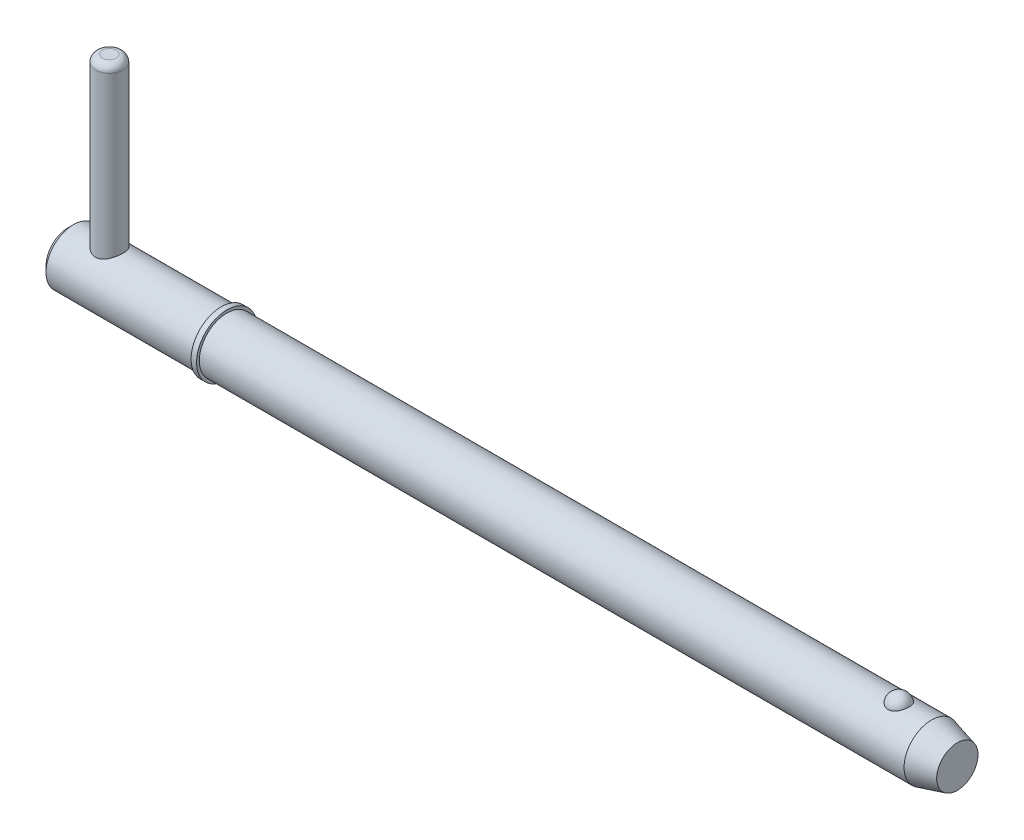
ISO-10303-21;
HEADER;
FILE_DESCRIPTION(('STEP AP214'),'2;1');
FILE_NAME('part.step','',(''),(''),'','','');
FILE_SCHEMA(('AUTOMOTIVE_DESIGN { 1 0 10303 214 1 1 1 1 }'));
ENDSEC;
DATA;
#1=APPLICATION_CONTEXT('core data for automotive mechanical design processes');
#2=APPLICATION_PROTOCOL_DEFINITION('international standard','automotive_design',2000,#1);
#3=PRODUCT_CONTEXT('',#1,'mechanical');
#4=PRODUCT('Part','Part','',(#3));
#5=PRODUCT_RELATED_PRODUCT_CATEGORY('part','',(#4));
#6=PRODUCT_DEFINITION_FORMATION('','',#4);
#7=PRODUCT_DEFINITION_CONTEXT('part definition',#1,'design');
#8=PRODUCT_DEFINITION('design','',#6,#7);
#9=PRODUCT_DEFINITION_SHAPE('','',#8);
#10=(LENGTH_UNIT() NAMED_UNIT(*) SI_UNIT(.MILLI.,.METRE.));
#11=(NAMED_UNIT(*) PLANE_ANGLE_UNIT() SI_UNIT($,.RADIAN.));
#12=(NAMED_UNIT(*) SI_UNIT($,.STERADIAN.) SOLID_ANGLE_UNIT());
#13=UNCERTAINTY_MEASURE_WITH_UNIT(LENGTH_MEASURE(1.E-05),#10,'distance_accuracy_value','');
#14=(GEOMETRIC_REPRESENTATION_CONTEXT(3) GLOBAL_UNCERTAINTY_ASSIGNED_CONTEXT((#13)) GLOBAL_UNIT_ASSIGNED_CONTEXT((#10,
#11,#12)) REPRESENTATION_CONTEXT('',''));
#15=CARTESIAN_POINT('',(0.,0.,0.));
#16=DIRECTION('',(0.,0.,1.));
#17=DIRECTION('',(1.,0.,0.));
#18=AXIS2_PLACEMENT_3D('',#15,#16,#17);
#19=CARTESIAN_POINT('',(4.755,22.225,0.));
#20=DIRECTION('',(0.,-1.,0.));
#21=DIRECTION('',(0.,0.,-1.));
#22=AXIS2_PLACEMENT_3D('',#19,#20,#21);
#23=CYLINDRICAL_SURFACE('',#22,1.585);
#24=CARTESIAN_POINT('',(4.755,-2.3825,0.));
#25=DIRECTION('',(0.,1.,0.));
#26=DIRECTION('',(0.,0.,1.));
#27=AXIS2_PLACEMENT_3D('',#24,#25,#26);
#28=CIRCLE('',#27,1.585);
#29=CARTESIAN_POINT('',(4.755,-2.3825,1.585));
#30=VERTEX_POINT('',#29);
#31=EDGE_CURVE('P0_E25',#30,#30,#28,.T.);
#32=ORIENTED_EDGE('',*,*,#31,.T.);
#33=EDGE_LOOP('',(#32));
#34=FACE_BOUND('',#33,.T.);
#35=CARTESIAN_POINT('',(4.755,21.4325,0.));
#36=DIRECTION('',(0.,1.,0.));
#37=DIRECTION('',(0.,0.,1.));
#38=AXIS2_PLACEMENT_3D('',#35,#36,#37);
#39=CIRCLE('',#38,1.585);
#40=CARTESIAN_POINT('',(4.755,21.4325,1.585));
#41=VERTEX_POINT('',#40);
#42=EDGE_CURVE('P0_E29',#41,#41,#39,.F.);
#43=ORIENTED_EDGE('',*,*,#42,.T.);
#44=EDGE_LOOP('',(#43));
#45=FACE_BOUND('',#44,.T.);
#46=ADVANCED_FACE('P0_F14',(#34,#45),#23,.T.);
#47=CARTESIAN_POINT('',(4.755,22.225,0.));
#48=DIRECTION('',(0.,1.,0.));
#49=DIRECTION('',(0.,0.,1.));
#50=AXIS2_PLACEMENT_3D('',#47,#48,#49);
#51=PLANE('',#50);
#52=CARTESIAN_POINT('',(4.755,22.225,0.));
#53=DIRECTION('',(0.,1.,0.));
#54=DIRECTION('',(0.,0.,1.));
#55=AXIS2_PLACEMENT_3D('',#52,#53,#54);
#56=CIRCLE('',#55,0.7925);
#57=CARTESIAN_POINT('',(4.755,22.225,0.7925));
#58=VERTEX_POINT('',#57);
#59=EDGE_CURVE('P0_E10',#58,#58,#56,.T.);
#60=ORIENTED_EDGE('',*,*,#59,.T.);
#61=EDGE_LOOP('',(#60));
#62=FACE_BOUND('',#61,.T.);
#63=ADVANCED_FACE('P0_F46',(#62),#51,.T.);
#64=CARTESIAN_POINT('',(4.755,-3.175,0.));
#65=DIRECTION('',(0.,1.,0.));
#66=DIRECTION('',(0.,0.,1.));
#67=AXIS2_PLACEMENT_3D('',#64,#65,#66);
#68=PLANE('',#67);
#69=CARTESIAN_POINT('',(4.755,-3.175,0.));
#70=DIRECTION('',(0.,1.,0.));
#71=DIRECTION('',(0.,0.,1.));
#72=AXIS2_PLACEMENT_3D('',#69,#70,#71);
#73=CIRCLE('',#72,0.7925);
#74=CARTESIAN_POINT('',(4.755,-3.175,0.7925));
#75=VERTEX_POINT('',#74);
#76=EDGE_CURVE('P0_E21',#75,#75,#73,.F.);
#77=ORIENTED_EDGE('',*,*,#76,.T.);
#78=EDGE_LOOP('',(#77));
#79=FACE_BOUND('',#78,.T.);
#80=ADVANCED_FACE('P0_F43',(#79),#68,.F.);
#81=CARTESIAN_POINT('',(4.755,-2.3825,0.));
#82=DIRECTION('',(0.,1.,0.));
#83=DIRECTION('',(0.,0.,1.));
#84=AXIS2_PLACEMENT_3D('',#81,#82,#83);
#85=DEGENERATE_TOROIDAL_SURFACE('',#84,0.7925,0.7925,.T.);
#86=ORIENTED_EDGE('',*,*,#76,.F.);
#87=EDGE_LOOP('',(#86));
#88=FACE_BOUND('',#87,.T.);
#89=ORIENTED_EDGE('',*,*,#31,.F.);
#90=EDGE_LOOP('',(#89));
#91=FACE_BOUND('',#90,.T.);
#92=ADVANCED_FACE('P0_F38',(#88,#91),#85,.T.);
#93=CARTESIAN_POINT('',(4.755,21.4325,0.));
#94=DIRECTION('',(0.,1.,0.));
#95=DIRECTION('',(0.,0.,1.));
#96=AXIS2_PLACEMENT_3D('',#93,#94,#95);
#97=DEGENERATE_TOROIDAL_SURFACE('',#96,0.7925,0.7925,.T.);
#98=ORIENTED_EDGE('',*,*,#42,.F.);
#99=EDGE_LOOP('',(#98));
#100=FACE_BOUND('',#99,.T.);
#101=ORIENTED_EDGE('',*,*,#59,.F.);
#102=EDGE_LOOP('',(#101));
#103=FACE_BOUND('',#102,.T.);
#104=ADVANCED_FACE('P0_F16',(#100,#103),#97,.T.);
#105=CLOSED_SHELL('',(#46,#63,#80,#92,#104));
#106=MANIFOLD_SOLID_BREP('P0_B1',#105);
#107=CARTESIAN_POINT('',(0.,0.,0.));
#108=DIRECTION('',(1.,0.,0.));
#109=DIRECTION('',(0.,0.,-1.));
#110=AXIS2_PLACEMENT_3D('',#107,#108,#109);
#111=CYLINDRICAL_SURFACE('',#110,3.175);
#112=CARTESIAN_POINT('',(99.4476846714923,0.,0.));
#113=DIRECTION('',(1.,0.,0.));
#114=DIRECTION('',(0.,0.,-1.));
#115=AXIS2_PLACEMENT_3D('',#112,#113,#114);
#116=CIRCLE('',#115,3.175);
#117=CARTESIAN_POINT('',(99.4476846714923,0.,-3.175));
#118=VERTEX_POINT('',#117);
#119=EDGE_CURVE('P1_E81',#118,#118,#116,.T.);
#120=ORIENTED_EDGE('',*,*,#119,.F.);
#121=EDGE_LOOP('',(#120));
#122=FACE_BOUND('',#121,.T.);
#123=CARTESIAN_POINT('',(18.29,0.,0.));
#124=DIRECTION('',(1.,0.,0.));
#125=DIRECTION('',(0.,0.,-1.));
#126=AXIS2_PLACEMENT_3D('',#123,#124,#125);
#127=CIRCLE('',#126,3.175);
#128=CARTESIAN_POINT('',(18.29,0.,-3.175));
#129=VERTEX_POINT('',#128);
#130=EDGE_CURVE('P1_E85',#129,#129,#127,.T.);
#131=ORIENTED_EDGE('',*,*,#130,.T.);
#132=EDGE_LOOP('',(#131));
#133=FACE_BOUND('',#132,.T.);
#134=CARTESIAN_POINT('',(95.6757276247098,2.92898950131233,1.2254164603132));
#135=CARTESIAN_POINT('',(95.612316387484,2.92899434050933,1.22541146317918));
#136=CARTESIAN_POINT('',(95.5487979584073,2.93112688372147,1.2203464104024));
#137=CARTESIAN_POINT('',(95.4235306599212,2.93942752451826,1.20020949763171));
#138=CARTESIAN_POINT('',(95.3617869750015,2.9456063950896,1.1851109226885));
#139=CARTESIAN_POINT('',(95.2420651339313,2.96127115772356,1.14540352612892));
#140=CARTESIAN_POINT('',(95.1840775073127,2.97074831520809,1.12081980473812));
#141=CARTESIAN_POINT('',(95.0731943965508,2.99197584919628,1.06285154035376));
#142=CARTESIAN_POINT('',(95.0202966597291,3.0037252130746,1.02947091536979));
#143=CARTESIAN_POINT('',(94.9192688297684,3.02865714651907,0.953674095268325));
#144=CARTESIAN_POINT('',(94.871324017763,3.04187163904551,0.911021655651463));
#145=CARTESIAN_POINT('',(94.7830360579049,3.06808741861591,0.818400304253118));
#146=CARTESIAN_POINT('',(94.7426952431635,3.08108863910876,0.768429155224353));
#147=CARTESIAN_POINT('',(94.6688039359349,3.10614903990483,0.660064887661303));
#148=CARTESIAN_POINT('',(94.6356330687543,3.11814104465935,0.601396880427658));
#149=CARTESIAN_POINT('',(94.5791190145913,3.13926931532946,0.479026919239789));
#150=CARTESIAN_POINT('',(94.5557764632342,3.14840539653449,0.415324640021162));
#151=CARTESIAN_POINT('',(94.5191785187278,3.16298160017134,0.283885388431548));
#152=CARTESIAN_POINT('',(94.5060407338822,3.16837855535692,0.216110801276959));
#153=CARTESIAN_POINT('',(94.4905676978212,3.17475386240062,0.0791367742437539));
#154=CARTESIAN_POINT('',(94.488232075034,3.17573236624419,0.00993738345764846));
#155=CARTESIAN_POINT('',(94.4943886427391,3.17318075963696,-0.127420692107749));
#156=CARTESIAN_POINT('',(94.5028073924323,3.16968122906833,-0.19558325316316));
#157=CARTESIAN_POINT('',(94.5301752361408,3.1585790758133,-0.329413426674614));
#158=CARTESIAN_POINT('',(94.5491245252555,3.15097637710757,-0.395080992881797));
#159=CARTESIAN_POINT('',(94.5972057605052,3.13242485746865,-0.5221806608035));
#160=CARTESIAN_POINT('',(94.6263524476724,3.12147119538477,-0.583606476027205));
#161=CARTESIAN_POINT('',(94.6942352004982,3.09734973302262,-0.700436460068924));
#162=CARTESIAN_POINT('',(94.732972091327,3.08418174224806,-0.755840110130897));
#163=CARTESIAN_POINT('',(94.8194771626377,3.05694884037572,-0.859404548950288));
#164=CARTESIAN_POINT('',(94.8672961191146,3.04287919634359,-0.907521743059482));
#165=CARTESIAN_POINT('',(94.9707353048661,3.01548927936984,-0.994758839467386));
#166=CARTESIAN_POINT('',(95.0263549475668,3.0021689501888,-1.03387941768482));
#167=CARTESIAN_POINT('',(95.1428093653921,2.97810316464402,-1.10126594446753));
#168=CARTESIAN_POINT('',(95.2035182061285,2.96731170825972,-1.12973256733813));
#169=CARTESIAN_POINT('',(95.3293712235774,2.94928934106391,-1.17598467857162));
#170=CARTESIAN_POINT('',(95.3945137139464,2.94205708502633,-1.19377420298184));
#171=CARTESIAN_POINT('',(95.5238562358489,2.93233065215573,-1.21746387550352));
#172=CARTESIAN_POINT('',(95.5879385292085,2.92961621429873,-1.22391763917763));
#173=CARTESIAN_POINT('',(95.7163375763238,2.92855752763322,-1.22644976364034));
#174=CARTESIAN_POINT('',(95.7806542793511,2.93021238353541,-1.22253024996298));
#175=CARTESIAN_POINT('',(95.9055239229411,2.9375685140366,-1.20474140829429));
#176=CARTESIAN_POINT('',(95.966131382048,2.94313790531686,-1.19119621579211));
#177=CARTESIAN_POINT('',(96.0841106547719,2.95756226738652,-1.15491492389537));
#178=CARTESIAN_POINT('',(96.1414822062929,2.96641750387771,-1.13217808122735));
#179=CARTESIAN_POINT('',(96.2527699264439,2.98669918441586,-1.07755083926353));
#180=CARTESIAN_POINT('',(96.3065845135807,2.9981771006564,-1.04547308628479));
#181=CARTESIAN_POINT('',(96.4081473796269,3.02240235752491,-0.973220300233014));
#182=CARTESIAN_POINT('',(96.4558942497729,3.03514999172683,-0.933043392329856));
#183=CARTESIAN_POINT('',(96.5465817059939,3.06131230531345,-0.843372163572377));
#184=CARTESIAN_POINT('',(96.5891588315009,3.07472822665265,-0.793510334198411));
#185=CARTESIAN_POINT('',(96.6656765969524,3.10021106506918,-0.687241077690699));
#186=CARTESIAN_POINT('',(96.6996156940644,3.1122777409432,-0.630832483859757));
#187=CARTESIAN_POINT('',(96.7591209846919,3.134208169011,-0.51105938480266));
#188=CARTESIAN_POINT('',(96.7843892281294,3.14399040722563,-0.447531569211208));
#189=CARTESIAN_POINT('',(96.8245117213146,3.15983820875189,-0.31682749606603));
#190=CARTESIAN_POINT('',(96.8393659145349,3.16590375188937,-0.249651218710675));
#191=CARTESIAN_POINT('',(96.858358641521,3.17370076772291,-0.113549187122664));
#192=CARTESIAN_POINT('',(96.8624966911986,3.17543204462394,-0.0446233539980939));
#193=CARTESIAN_POINT('',(96.8599697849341,3.17438372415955,0.0929938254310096));
#194=CARTESIAN_POINT('',(96.8533050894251,3.17160423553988,0.16168517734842));
#195=CARTESIAN_POINT('',(96.8293754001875,3.1618438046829,0.296502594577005));
#196=CARTESIAN_POINT('',(96.8121674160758,3.15488546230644,0.362640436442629));
#197=CARTESIAN_POINT('',(96.767547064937,3.13748892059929,0.490896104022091));
#198=CARTESIAN_POINT('',(96.7401339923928,3.12705048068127,0.553013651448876));
#199=CARTESIAN_POINT('',(96.6754626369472,3.10369139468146,0.671876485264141));
#200=CARTESIAN_POINT('',(96.6381467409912,3.0907563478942,0.728587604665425));
#201=CARTESIAN_POINT('',(96.5545246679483,3.06381731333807,0.834653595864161));
#202=CARTESIAN_POINT('',(96.5082189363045,3.04981337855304,0.884008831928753));
#203=CARTESIAN_POINT('',(96.407718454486,3.02230423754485,0.973916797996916));
#204=CARTESIAN_POINT('',(96.353535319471,3.00879833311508,1.01448227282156));
#205=CARTESIAN_POINT('',(96.2385299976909,2.98383625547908,1.0857155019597));
#206=CARTESIAN_POINT('',(96.1777053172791,2.9723808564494,1.11637952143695));
#207=CARTESIAN_POINT('',(96.0533690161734,2.95329063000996,1.16592590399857));
#208=CARTESIAN_POINT('',(95.9900230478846,2.9455373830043,1.18517901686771));
#209=CARTESIAN_POINT('',(95.8607664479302,2.9342556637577,1.21284802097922));
#210=CARTESIAN_POINT('',(95.7948641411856,2.93071450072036,1.2212964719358));
#211=CARTESIAN_POINT('',(95.711116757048,2.9291525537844,1.22502505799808));
#212=CARTESIAN_POINT('',(95.6934263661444,2.92898815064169,1.22541785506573));
#213=CARTESIAN_POINT('',(95.6757276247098,2.92898950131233,1.2254164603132));
#214=B_SPLINE_CURVE_WITH_KNOTS('',3,(#134,#135,#136,#137,#138,#139,#140,#141,#142,#143,#144,
#145,#146,#147,#148,#149,#150,#151,#152,#153,#154,#155,#156,#157,#158,#159,#160,#161,#162,#163,
#164,#165,#166,#167,#168,#169,#170,#171,#172,#173,#174,#175,#176,#177,#178,#179,#180,#181,#182,
#183,#184,#185,#186,#187,#188,#189,#190,#191,#192,#193,#194,#195,#196,#197,#198,#199,#200,#201,
#202,#203,#204,#205,#206,#207,#208,#209,#210,#211,#212,#213),.UNSPECIFIED.,.T.,.F.,(4,2,2,2,2,2,
2,2,2,2,2,2,2,2,2,2,2,2,2,2,2,2,2,2,2,2,2,2,2,2,2,2,2,2,2,2,2,2,2,4),(0.,0.190186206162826,
0.380880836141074,0.571074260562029,0.761183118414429,0.956866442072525,1.15260970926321,
1.3570177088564,1.56143892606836,1.76818248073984,1.97491892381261,2.18025109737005,
2.38558707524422,2.59122111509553,2.79687285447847,3.00371012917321,3.2105318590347,
3.41323429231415,3.61586005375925,3.80828192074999,4.00066436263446,4.18685798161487,
4.37306665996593,4.56330302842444,4.75358348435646,4.95345287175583,5.15335793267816,
5.35957003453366,5.56578325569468,5.7720057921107,5.97822335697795,6.18333558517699,
6.38846199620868,6.59480900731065,6.80114579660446,7.00718137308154,7.21329457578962,
7.41228022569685,7.61066481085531,7.66374777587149),.UNSPECIFIED.);
#215=CARTESIAN_POINT('',(95.6757276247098,2.92898950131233,1.2254164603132));
#216=VERTEX_POINT('',#215);
#217=EDGE_CURVE('P1_E35',#216,#216,#214,.T.);
#218=ORIENTED_EDGE('',*,*,#217,.T.);
#219=EDGE_LOOP('',(#218));
#220=FACE_BOUND('',#219,.T.);
#221=ADVANCED_FACE('P1_F13',(#122,#133,#220),#111,.T.);
#222=CARTESIAN_POINT('',(0.,0.,0.));
#223=DIRECTION('',(-1.,0.,0.));
#224=DIRECTION('',(0.,0.,1.));
#225=AXIS2_PLACEMENT_3D('',#222,#223,#224);
#226=PLANE('',#225);
#227=CARTESIAN_POINT('',(0.,0.,0.));
#228=DIRECTION('',(1.,0.,0.));
#229=DIRECTION('',(0.,0.,-1.));
#230=AXIS2_PLACEMENT_3D('',#227,#228,#229);
#231=CIRCLE('',#230,2.54);
#232=CARTESIAN_POINT('',(0.,0.,-2.54));
#233=VERTEX_POINT('',#232);
#234=EDGE_CURVE('P1_E9',#233,#233,#231,.T.);
#235=ORIENTED_EDGE('',*,*,#234,.F.);
#236=EDGE_LOOP('',(#235));
#237=FACE_BOUND('',#236,.T.);
#238=ADVANCED_FACE('P1_F15',(#237),#226,.T.);
#239=CARTESIAN_POINT('',(0.634999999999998,0.,0.));
#240=DIRECTION('',(1.,0.,0.));
#241=DIRECTION('',(0.,0.,-1.));
#242=AXIS2_PLACEMENT_3D('',#239,#240,#241);
#243=CONICAL_SURFACE('',#242,3.175,0.78539816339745);
#244=ORIENTED_EDGE('',*,*,#234,.T.);
#245=EDGE_LOOP('',(#244));
#246=FACE_BOUND('',#245,.T.);
#247=CARTESIAN_POINT('',(0.634999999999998,0.,0.));
#248=DIRECTION('',(1.,0.,0.));
#249=DIRECTION('',(0.,0.,-1.));
#250=AXIS2_PLACEMENT_3D('',#247,#248,#249);
#251=CIRCLE('',#250,3.175);
#252=CARTESIAN_POINT('',(0.634999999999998,0.,-3.175));
#253=VERTEX_POINT('',#252);
#254=EDGE_CURVE('P1_E26',#253,#253,#251,.T.);
#255=ORIENTED_EDGE('',*,*,#254,.F.);
#256=EDGE_LOOP('',(#255));
#257=FACE_BOUND('',#256,.T.);
#258=ADVANCED_FACE('P1_F77',(#246,#257),#243,.T.);
#259=CARTESIAN_POINT('',(0.,0.,0.));
#260=DIRECTION('',(1.,0.,0.));
#261=DIRECTION('',(0.,0.,-1.));
#262=AXIS2_PLACEMENT_3D('',#259,#260,#261);
#263=CYLINDRICAL_SURFACE('',#262,3.175);
#264=CARTESIAN_POINT('',(4.755,-2.75107251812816,1.585));
#265=CARTESIAN_POINT('',(4.67238891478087,-2.7510796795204,1.58499425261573));
#266=CARTESIAN_POINT('',(4.58967306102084,-2.75485010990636,1.57849830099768));
#267=CARTESIAN_POINT('',(4.42677850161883,-2.76938647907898,1.55284486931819));
#268=CARTESIAN_POINT('',(4.34660551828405,-2.78016716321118,1.53366069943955));
#269=CARTESIAN_POINT('',(4.19146029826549,-2.80716278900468,1.48366329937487));
#270=CARTESIAN_POINT('',(4.11646293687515,-2.8233488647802,1.45291173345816));
#271=CARTESIAN_POINT('',(3.97271079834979,-2.85928672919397,1.38084067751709));
#272=CARTESIAN_POINT('',(3.90395634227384,-2.87903870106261,1.33952064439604));
#273=CARTESIAN_POINT('',(3.76839976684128,-2.921867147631,1.24350234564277));
#274=CARTESIAN_POINT('',(3.702222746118,-2.94508343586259,1.18798355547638));
#275=CARTESIAN_POINT('',(3.5796334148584,-2.99109588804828,1.06685014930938));
#276=CARTESIAN_POINT('',(3.52322596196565,-3.01389183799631,1.00123054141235));
#277=CARTESIAN_POINT('',(3.41807024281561,-3.05832598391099,0.856373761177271));
#278=CARTESIAN_POINT('',(3.37009053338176,-3.07978367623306,0.776518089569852));
#279=CARTESIAN_POINT('',(3.28853137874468,-3.11730894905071,0.608596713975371));
#280=CARTESIAN_POINT('',(3.25494287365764,-3.1333799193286,0.520536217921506));
#281=CARTESIAN_POINT('',(3.20559401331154,-3.15731341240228,0.345327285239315));
#282=CARTESIAN_POINT('',(3.18873760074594,-3.16567752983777,0.258557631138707));
#283=CARTESIAN_POINT('',(3.16972238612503,-3.17512718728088,0.0830496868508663));
#284=CARTESIAN_POINT('',(3.16755472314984,-3.17621711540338,-0.00568738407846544));
#285=CARTESIAN_POINT('',(3.1775542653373,-3.17123385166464,-0.174372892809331));
#286=CARTESIAN_POINT('',(3.18849502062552,-3.16577346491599,-0.254416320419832));
#287=CARTESIAN_POINT('',(3.22220680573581,-3.14922844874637,-0.411354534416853));
#288=CARTESIAN_POINT('',(3.2449787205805,-3.13814339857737,-0.488249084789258));
#289=CARTESIAN_POINT('',(3.30185558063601,-3.111172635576,-0.638050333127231));
#290=CARTESIAN_POINT('',(3.33611332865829,-3.09522247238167,-0.710886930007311));
#291=CARTESIAN_POINT('',(3.41477890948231,-3.05996035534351,-0.849953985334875));
#292=CARTESIAN_POINT('',(3.45919037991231,-3.04064719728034,-0.916182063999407));
#293=CARTESIAN_POINT('',(3.5617148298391,-2.99832415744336,-1.04681642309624));
#294=CARTESIAN_POINT('',(3.62072497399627,-2.97513741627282,-1.11046186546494));
#295=CARTESIAN_POINT('',(3.7483697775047,-2.92885066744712,-1.22736291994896));
#296=CARTESIAN_POINT('',(3.81701173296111,-2.90575073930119,-1.2806105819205));
#297=CARTESIAN_POINT('',(3.96727993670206,-2.86067370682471,-1.37849835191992));
#298=CARTESIAN_POINT('',(4.04945242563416,-2.83885964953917,-1.42238246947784));
#299=CARTESIAN_POINT('',(4.2213558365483,-2.80110454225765,-1.49537418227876));
#300=CARTESIAN_POINT('',(4.3110787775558,-2.78515738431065,-1.52449715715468));
#301=CARTESIAN_POINT('',(4.48806324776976,-2.76271292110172,-1.56478065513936));
#302=CARTESIAN_POINT('',(4.57495732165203,-2.75556745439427,-1.57718067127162));
#303=CARTESIAN_POINT('',(4.74985771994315,-2.74969306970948,-1.58740564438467));
#304=CARTESIAN_POINT('',(4.8378632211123,-2.75095824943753,-1.58524082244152));
#305=CARTESIAN_POINT('',(5.00227282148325,-2.76107477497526,-1.56753530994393));
#306=CARTESIAN_POINT('',(5.07889680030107,-2.76908515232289,-1.55347662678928));
#307=CARTESIAN_POINT('',(5.22855309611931,-2.79054849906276,-1.51458035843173));
#308=CARTESIAN_POINT('',(5.30158424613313,-2.80400322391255,-1.489739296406));
#309=CARTESIAN_POINT('',(5.44583114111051,-2.83556995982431,-1.42877335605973));
#310=CARTESIAN_POINT('',(5.51680600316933,-2.85386886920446,-1.39217900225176));
#311=CARTESIAN_POINT('',(5.6520174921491,-2.89289503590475,-1.30915485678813));
#312=CARTESIAN_POINT('',(5.71625063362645,-2.91362353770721,-1.26272001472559));
#313=CARTESIAN_POINT('',(5.8445938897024,-2.95830220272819,-1.15451693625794));
#314=CARTESIAN_POINT('',(5.90767560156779,-2.98233004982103,-1.09155543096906));
#315=CARTESIAN_POINT('',(6.0226995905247,-3.02864458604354,-0.955560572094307));
#316=CARTESIAN_POINT('',(6.07463814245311,-3.05093069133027,-0.882523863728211));
#317=CARTESIAN_POINT('',(6.16704288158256,-3.09200671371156,-0.725836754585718));
#318=CARTESIAN_POINT('',(6.20717458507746,-3.11069030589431,-0.64195924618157));
#319=CARTESIAN_POINT('',(6.27235859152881,-3.1416474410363,-0.467442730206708));
#320=CARTESIAN_POINT('',(6.29742409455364,-3.15392659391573,-0.376809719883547));
#321=CARTESIAN_POINT('',(6.32960989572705,-3.16979844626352,-0.200314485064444));
#322=CARTESIAN_POINT('',(6.33816324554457,-3.17408359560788,-0.114775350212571));
#323=CARTESIAN_POINT('',(6.34130309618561,-3.17565001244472,0.0566108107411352));
#324=CARTESIAN_POINT('',(6.33589445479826,-3.17293371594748,0.142457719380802));
#325=CARTESIAN_POINT('',(6.31221457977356,-3.16120608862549,0.306097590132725));
#326=CARTESIAN_POINT('',(6.2948097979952,-3.15261910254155,0.38404960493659));
#327=CARTESIAN_POINT('',(6.24879775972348,-3.13040364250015,0.535801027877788));
#328=CARTESIAN_POINT('',(6.22018889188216,-3.11677444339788,0.609599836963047));
#329=CARTESIAN_POINT('',(6.15130303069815,-3.08497808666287,0.754502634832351));
#330=CARTESIAN_POINT('',(6.11057850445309,-3.0666414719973,0.82535556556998));
#331=CARTESIAN_POINT('',(6.01917980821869,-3.02735012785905,0.95951596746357));
#332=CARTESIAN_POINT('',(5.96850106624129,-3.00639419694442,1.02281994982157));
#333=CARTESIAN_POINT('',(5.8528006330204,-2.96149402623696,1.1467073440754));
#334=CARTESIAN_POINT('',(5.78685463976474,-2.93745961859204,1.20639723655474));
#335=CARTESIAN_POINT('',(5.64552278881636,-2.89084502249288,1.31419099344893));
#336=CARTESIAN_POINT('',(5.57012871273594,-2.8682661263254,1.36228466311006));
#337=CARTESIAN_POINT('',(5.40892145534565,-2.82661780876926,1.44677201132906));
#338=CARTESIAN_POINT('',(5.32285703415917,-2.80767948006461,1.48275497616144));
#339=CARTESIAN_POINT('',(5.14469010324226,-2.77716572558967,1.53916557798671));
#340=CARTESIAN_POINT('',(5.05260892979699,-2.76556569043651,1.55964525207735));
#341=CARTESIAN_POINT('',(4.92544162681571,-2.75613775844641,1.57618070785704));
#342=CARTESIAN_POINT('',(4.89147210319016,-2.75424493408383,1.57948285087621));
#343=CARTESIAN_POINT('',(4.82334103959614,-2.75171079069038,1.58389375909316));
#344=CARTESIAN_POINT('',(4.78917948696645,-2.75106955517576,1.58500237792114));
#345=CARTESIAN_POINT('',(4.755,-2.75107251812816,1.585));
#346=B_SPLINE_CURVE_WITH_KNOTS('',3,(#264,#265,#266,#267,#268,#269,#270,#271,#272,#273,#274,
#275,#276,#277,#278,#279,#280,#281,#282,#283,#284,#285,#286,#287,#288,#289,#290,#291,#292,#293,
#294,#295,#296,#297,#298,#299,#300,#301,#302,#303,#304,#305,#306,#307,#308,#309,#310,#311,#312,
#313,#314,#315,#316,#317,#318,#319,#320,#321,#322,#323,#324,#325,#326,#327,#328,#329,#330,#331,
#332,#333,#334,#335,#336,#337,#338,#339,#340,#341,#342,#343,#344,#345),.UNSPECIFIED.,.T.,.F.,(4,
2,2,2,2,2,2,2,2,2,2,2,2,2,2,2,2,2,2,2,2,2,2,2,2,2,2,2,2,2,2,2,2,2,2,2,2,2,2,2,4),(0.,
0.247689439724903,0.495901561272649,0.742808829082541,0.989728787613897,1.25694656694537,
1.52429683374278,1.80959781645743,2.0947189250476,2.35960564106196,2.62433255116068,
2.86610932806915,3.1079041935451,3.35305262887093,3.59828902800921,3.86665310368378,
4.13522157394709,4.4207514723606,4.70598326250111,4.9686344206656,5.23110127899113,
5.46499114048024,5.69895647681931,5.94376186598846,6.1886932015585,6.46438263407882,
6.74016408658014,7.0231370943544,7.30586181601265,7.5626977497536,7.81944433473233,
8.05935987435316,8.29930993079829,8.54954401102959,8.79989329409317,9.07508848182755,
9.35052473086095,9.63453318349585,9.91758407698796,10.0200561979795,10.1225351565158),.UNSPECIFIED.);
#347=CARTESIAN_POINT('',(4.755,-2.75107251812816,1.585));
#348=VERTEX_POINT('',#347);
#349=EDGE_CURVE('P1_E17',#348,#348,#346,.T.);
#350=ORIENTED_EDGE('',*,*,#349,.F.);
#351=EDGE_LOOP('',(#350));
#352=FACE_BOUND('',#351,.T.);
#353=CARTESIAN_POINT('',(4.755,2.75107251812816,1.585));
#354=CARTESIAN_POINT('',(4.83761108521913,2.7510796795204,1.58499425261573));
#355=CARTESIAN_POINT('',(4.92032693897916,2.75485010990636,1.57849830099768));
#356=CARTESIAN_POINT('',(5.08322149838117,2.76938647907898,1.55284486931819));
#357=CARTESIAN_POINT('',(5.16339448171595,2.78016716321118,1.53366069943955));
#358=CARTESIAN_POINT('',(5.31853970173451,2.80716278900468,1.48366329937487));
#359=CARTESIAN_POINT('',(5.39353706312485,2.8233488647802,1.45291173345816));
#360=CARTESIAN_POINT('',(5.53728920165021,2.85928672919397,1.38084067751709));
#361=CARTESIAN_POINT('',(5.60604365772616,2.87903870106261,1.33952064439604));
#362=CARTESIAN_POINT('',(5.74160023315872,2.921867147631,1.24350234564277));
#363=CARTESIAN_POINT('',(5.807777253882,2.94508343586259,1.18798355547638));
#364=CARTESIAN_POINT('',(5.9303665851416,2.99109588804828,1.06685014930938));
#365=CARTESIAN_POINT('',(5.98677403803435,3.01389183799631,1.00123054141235));
#366=CARTESIAN_POINT('',(6.09192975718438,3.05832598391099,0.85637376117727));
#367=CARTESIAN_POINT('',(6.13990946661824,3.07978367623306,0.776518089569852));
#368=CARTESIAN_POINT('',(6.22146862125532,3.11730894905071,0.608596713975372));
#369=CARTESIAN_POINT('',(6.25505712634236,3.1333799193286,0.520536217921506));
#370=CARTESIAN_POINT('',(6.30440598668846,3.15731341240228,0.345327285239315));
#371=CARTESIAN_POINT('',(6.32126239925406,3.16567752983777,0.258557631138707));
#372=CARTESIAN_POINT('',(6.34027761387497,3.17512718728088,0.0830496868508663));
#373=CARTESIAN_POINT('',(6.34244527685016,3.17621711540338,-0.00568738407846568));
#374=CARTESIAN_POINT('',(6.3324457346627,3.17123385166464,-0.174372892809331));
#375=CARTESIAN_POINT('',(6.32150497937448,3.16577346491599,-0.254416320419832));
#376=CARTESIAN_POINT('',(6.28779319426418,3.14922844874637,-0.411354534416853));
#377=CARTESIAN_POINT('',(6.2650212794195,3.13814339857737,-0.488249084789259));
#378=CARTESIAN_POINT('',(6.20814441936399,3.111172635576,-0.638050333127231));
#379=CARTESIAN_POINT('',(6.17388667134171,3.09522247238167,-0.710886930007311));
#380=CARTESIAN_POINT('',(6.09522109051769,3.05996035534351,-0.849953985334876));
#381=CARTESIAN_POINT('',(6.05080962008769,3.04064719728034,-0.916182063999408));
#382=CARTESIAN_POINT('',(5.9482851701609,2.99832415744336,-1.04681642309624));
#383=CARTESIAN_POINT('',(5.88927502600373,2.97513741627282,-1.11046186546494));
#384=CARTESIAN_POINT('',(5.7616302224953,2.92885066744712,-1.22736291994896));
#385=CARTESIAN_POINT('',(5.69298826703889,2.90575073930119,-1.2806105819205));
#386=CARTESIAN_POINT('',(5.54272006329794,2.86067370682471,-1.37849835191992));
#387=CARTESIAN_POINT('',(5.46054757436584,2.83885964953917,-1.42238246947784));
#388=CARTESIAN_POINT('',(5.2886441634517,2.80110454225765,-1.49537418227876));
#389=CARTESIAN_POINT('',(5.19892122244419,2.78515738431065,-1.52449715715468));
#390=CARTESIAN_POINT('',(5.02193675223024,2.76271292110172,-1.56478065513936));
#391=CARTESIAN_POINT('',(4.93504267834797,2.75556745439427,-1.57718067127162));
#392=CARTESIAN_POINT('',(4.76014228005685,2.74969306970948,-1.58740564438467));
#393=CARTESIAN_POINT('',(4.6721367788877,2.75095824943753,-1.58524082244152));
#394=CARTESIAN_POINT('',(4.50772717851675,2.76107477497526,-1.56753530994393));
#395=CARTESIAN_POINT('',(4.43110319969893,2.76908515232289,-1.55347662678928));
#396=CARTESIAN_POINT('',(4.28144690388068,2.79054849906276,-1.51458035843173));
#397=CARTESIAN_POINT('',(4.20841575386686,2.80400322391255,-1.489739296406));
#398=CARTESIAN_POINT('',(4.06416885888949,2.83556995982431,-1.42877335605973));
#399=CARTESIAN_POINT('',(3.99319399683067,2.85386886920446,-1.39217900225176));
#400=CARTESIAN_POINT('',(3.8579825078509,2.89289503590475,-1.30915485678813));
#401=CARTESIAN_POINT('',(3.79374936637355,2.91362353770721,-1.26272001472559));
#402=CARTESIAN_POINT('',(3.6654061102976,2.95830220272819,-1.15451693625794));
#403=CARTESIAN_POINT('',(3.60232439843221,2.98233004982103,-1.09155543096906));
#404=CARTESIAN_POINT('',(3.4873004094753,3.02864458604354,-0.955560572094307));
#405=CARTESIAN_POINT('',(3.43536185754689,3.05093069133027,-0.88252386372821));
#406=CARTESIAN_POINT('',(3.34295711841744,3.09200671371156,-0.725836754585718));
#407=CARTESIAN_POINT('',(3.30282541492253,3.11069030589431,-0.64195924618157));
#408=CARTESIAN_POINT('',(3.23764140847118,3.14164744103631,-0.467442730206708));
#409=CARTESIAN_POINT('',(3.21257590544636,3.15392659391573,-0.376809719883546));
#410=CARTESIAN_POINT('',(3.18039010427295,3.16979844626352,-0.200314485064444));
#411=CARTESIAN_POINT('',(3.17183675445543,3.17408359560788,-0.114775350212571));
#412=CARTESIAN_POINT('',(3.16869690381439,3.17565001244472,0.0566108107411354));
#413=CARTESIAN_POINT('',(3.17410554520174,3.17293371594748,0.142457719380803));
#414=CARTESIAN_POINT('',(3.19778542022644,3.16120608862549,0.306097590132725));
#415=CARTESIAN_POINT('',(3.2151902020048,3.15261910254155,0.384049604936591));
#416=CARTESIAN_POINT('',(3.26120224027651,3.13040364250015,0.535801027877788));
#417=CARTESIAN_POINT('',(3.28981110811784,3.11677444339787,0.609599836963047));
#418=CARTESIAN_POINT('',(3.35869696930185,3.08497808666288,0.754502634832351));
#419=CARTESIAN_POINT('',(3.39942149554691,3.0666414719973,0.82535556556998));
#420=CARTESIAN_POINT('',(3.49082019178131,3.02735012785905,0.95951596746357));
#421=CARTESIAN_POINT('',(3.54149893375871,3.00639419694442,1.02281994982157));
#422=CARTESIAN_POINT('',(3.6571993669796,2.96149402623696,1.1467073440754));
#423=CARTESIAN_POINT('',(3.72314536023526,2.93745961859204,1.20639723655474));
#424=CARTESIAN_POINT('',(3.86447721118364,2.89084502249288,1.31419099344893));
#425=CARTESIAN_POINT('',(3.93987128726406,2.8682661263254,1.36228466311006));
#426=CARTESIAN_POINT('',(4.10107854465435,2.82661780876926,1.44677201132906));
#427=CARTESIAN_POINT('',(4.18714296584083,2.80767948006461,1.48275497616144));
#428=CARTESIAN_POINT('',(4.36530989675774,2.77716572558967,1.53916557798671));
#429=CARTESIAN_POINT('',(4.45739107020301,2.76556569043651,1.55964525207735));
#430=CARTESIAN_POINT('',(4.58455837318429,2.75613775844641,1.57618070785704));
#431=CARTESIAN_POINT('',(4.61852789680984,2.75424493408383,1.57948285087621));
#432=CARTESIAN_POINT('',(4.68665896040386,2.75171079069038,1.58389375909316));
#433=CARTESIAN_POINT('',(4.72082051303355,2.75106955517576,1.58500237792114));
#434=CARTESIAN_POINT('',(4.755,2.75107251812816,1.585));
#435=B_SPLINE_CURVE_WITH_KNOTS('',3,(#353,#354,#355,#356,#357,#358,#359,#360,#361,#362,#363,
#364,#365,#366,#367,#368,#369,#370,#371,#372,#373,#374,#375,#376,#377,#378,#379,#380,#381,#382,
#383,#384,#385,#386,#387,#388,#389,#390,#391,#392,#393,#394,#395,#396,#397,#398,#399,#400,#401,
#402,#403,#404,#405,#406,#407,#408,#409,#410,#411,#412,#413,#414,#415,#416,#417,#418,#419,#420,
#421,#422,#423,#424,#425,#426,#427,#428,#429,#430,#431,#432,#433,#434),.UNSPECIFIED.,.T.,.F.,(4,
2,2,2,2,2,2,2,2,2,2,2,2,2,2,2,2,2,2,2,2,2,2,2,2,2,2,2,2,2,2,2,2,2,2,2,2,2,2,2,4),(0.,
0.247689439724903,0.495901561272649,0.742808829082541,0.989728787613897,1.25694656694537,
1.52429683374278,1.80959781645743,2.0947189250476,2.35960564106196,2.62433255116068,
2.86610932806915,3.1079041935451,3.35305262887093,3.59828902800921,3.86665310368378,
4.13522157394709,4.4207514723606,4.70598326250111,4.9686344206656,5.23110127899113,
5.46499114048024,5.69895647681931,5.94376186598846,6.1886932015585,6.46438263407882,
6.74016408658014,7.0231370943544,7.30586181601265,7.5626977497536,7.81944433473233,
8.05935987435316,8.29930993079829,8.54954401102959,8.79989329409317,9.07508848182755,
9.35052473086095,9.63453318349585,9.91758407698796,10.0200561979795,10.1225351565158),.UNSPECIFIED.);
#436=CARTESIAN_POINT('',(4.755,2.75107251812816,1.585));
#437=VERTEX_POINT('',#436);
#438=EDGE_CURVE('P1_E43',#437,#437,#435,.T.);
#439=ORIENTED_EDGE('',*,*,#438,.F.);
#440=EDGE_LOOP('',(#439));
#441=FACE_BOUND('',#440,.T.);
#442=ORIENTED_EDGE('',*,*,#254,.T.);
#443=EDGE_LOOP('',(#442));
#444=FACE_BOUND('',#443,.T.);
#445=CARTESIAN_POINT('',(17.655,0.,0.));
#446=DIRECTION('',(1.,0.,0.));
#447=DIRECTION('',(0.,0.,-1.));
#448=AXIS2_PLACEMENT_3D('',#445,#446,#447);
#449=CIRCLE('',#448,3.175);
#450=CARTESIAN_POINT('',(17.655,0.,-3.175));
#451=VERTEX_POINT('',#450);
#452=EDGE_CURVE('P1_E31',#451,#451,#449,.T.);
#453=ORIENTED_EDGE('',*,*,#452,.F.);
#454=EDGE_LOOP('',(#453));
#455=FACE_BOUND('',#454,.T.);
#456=ADVANCED_FACE('P1_F103',(#352,#441,#444,#455),#263,.T.);
#457=CARTESIAN_POINT('',(17.655,3.175,0.));
#458=DIRECTION('',(-1.,0.,0.));
#459=DIRECTION('',(0.,0.,1.));
#460=AXIS2_PLACEMENT_3D('',#457,#458,#459);
#461=PLANE('',#460);
#462=ORIENTED_EDGE('',*,*,#452,.T.);
#463=EDGE_LOOP('',(#462));
#464=FACE_BOUND('',#463,.T.);
#465=CARTESIAN_POINT('',(17.655,0.,0.));
#466=DIRECTION('',(1.,0.,0.));
#467=DIRECTION('',(0.,0.,-1.));
#468=AXIS2_PLACEMENT_3D('',#465,#466,#467);
#469=CIRCLE('',#468,3.4925);
#470=CARTESIAN_POINT('',(17.655,0.,-3.4925));
#471=VERTEX_POINT('',#470);
#472=EDGE_CURVE('P1_E91',#471,#471,#469,.T.);
#473=ORIENTED_EDGE('',*,*,#472,.F.);
#474=EDGE_LOOP('',(#473));
#475=FACE_BOUND('',#474,.T.);
#476=ADVANCED_FACE('P1_F100',(#464,#475),#461,.T.);
#477=CARTESIAN_POINT('',(0.,0.,0.));
#478=DIRECTION('',(1.,0.,0.));
#479=DIRECTION('',(0.,0.,-1.));
#480=AXIS2_PLACEMENT_3D('',#477,#478,#479);
#481=CYLINDRICAL_SURFACE('',#480,3.4925);
#482=ORIENTED_EDGE('',*,*,#472,.T.);
#483=EDGE_LOOP('',(#482));
#484=FACE_BOUND('',#483,.T.);
#485=CARTESIAN_POINT('',(18.29,0.,0.));
#486=DIRECTION('',(1.,0.,0.));
#487=DIRECTION('',(0.,0.,-1.));
#488=AXIS2_PLACEMENT_3D('',#485,#486,#487);
#489=CIRCLE('',#488,3.4925);
#490=CARTESIAN_POINT('',(18.29,0.,-3.4925));
#491=VERTEX_POINT('',#490);
#492=EDGE_CURVE('P1_E88',#491,#491,#489,.T.);
#493=ORIENTED_EDGE('',*,*,#492,.F.);
#494=EDGE_LOOP('',(#493));
#495=FACE_BOUND('',#494,.T.);
#496=ADVANCED_FACE('P1_F68',(#484,#495),#481,.T.);
#497=CARTESIAN_POINT('',(18.29,3.4925,0.));
#498=DIRECTION('',(1.,0.,0.));
#499=DIRECTION('',(0.,0.,-1.));
#500=AXIS2_PLACEMENT_3D('',#497,#498,#499);
#501=PLANE('',#500);
#502=ORIENTED_EDGE('',*,*,#492,.T.);
#503=EDGE_LOOP('',(#502));
#504=FACE_BOUND('',#503,.T.);
#505=ORIENTED_EDGE('',*,*,#130,.F.);
#506=EDGE_LOOP('',(#505));
#507=FACE_BOUND('',#506,.T.);
#508=ADVANCED_FACE('P1_F62',(#504,#507),#501,.T.);
#509=CARTESIAN_POINT('',(102.41,0.,0.));
#510=DIRECTION('',(-1.,0.,0.));
#511=DIRECTION('',(0.,0.,1.));
#512=AXIS2_PLACEMENT_3D('',#509,#510,#511);
#513=CONICAL_SURFACE('',#512,2.38125000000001,0.261799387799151);
#514=ORIENTED_EDGE('',*,*,#119,.T.);
#515=EDGE_LOOP('',(#514));
#516=FACE_BOUND('',#515,.T.);
#517=CARTESIAN_POINT('',(102.41,0.,0.));
#518=DIRECTION('',(1.,0.,0.));
#519=DIRECTION('',(0.,0.,-1.));
#520=AXIS2_PLACEMENT_3D('',#517,#518,#519);
#521=CIRCLE('',#520,2.38125000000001);
#522=CARTESIAN_POINT('',(102.41,0.,-2.38125000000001));
#523=VERTEX_POINT('',#522);
#524=EDGE_CURVE('P1_E42',#523,#523,#521,.T.);
#525=ORIENTED_EDGE('',*,*,#524,.F.);
#526=EDGE_LOOP('',(#525));
#527=FACE_BOUND('',#526,.T.);
#528=ADVANCED_FACE('P1_F59',(#516,#527),#513,.T.);
#529=CARTESIAN_POINT('',(102.41,2.38125000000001,0.));
#530=DIRECTION('',(1.,0.,0.));
#531=DIRECTION('',(0.,0.,-1.));
#532=AXIS2_PLACEMENT_3D('',#529,#530,#531);
#533=PLANE('',#532);
#534=ORIENTED_EDGE('',*,*,#524,.T.);
#535=EDGE_LOOP('',(#534));
#536=FACE_BOUND('',#535,.T.);
#537=ADVANCED_FACE('P1_F55',(#536),#533,.T.);
#538=CARTESIAN_POINT('',(95.6757276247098,2.8575,0.));
#539=DIRECTION('',(-1.,0.,0.));
#540=DIRECTION('',(0.,1.,0.));
#541=AXIS2_PLACEMENT_3D('',#538,#539,#540);
#542=SPHERICAL_SURFACE('',#541,1.22750000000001);
#543=ORIENTED_EDGE('',*,*,#217,.F.);
#544=EDGE_LOOP('',(#543));
#545=FACE_BOUND('',#544,.T.);
#546=ADVANCED_FACE('P1_F50',(#545),#542,.T.);
#547=CARTESIAN_POINT('',(4.755,-3.4925,0.));
#548=DIRECTION('',(0.,1.,0.));
#549=DIRECTION('',(0.,0.,1.));
#550=AXIS2_PLACEMENT_3D('',#547,#548,#549);
#551=CYLINDRICAL_SURFACE('',#550,1.585);
#552=ORIENTED_EDGE('',*,*,#349,.T.);
#553=EDGE_LOOP('',(#552));
#554=FACE_BOUND('',#553,.T.);
#555=ORIENTED_EDGE('',*,*,#438,.T.);
#556=EDGE_LOOP('',(#555));
#557=FACE_BOUND('',#556,.T.);
#558=ADVANCED_FACE('P1_F54',(#554,#557),#551,.F.);
#559=CLOSED_SHELL('',(#221,#238,#258,#456,#476,#496,#508,#528,#537,#546,#558));
#560=MANIFOLD_SOLID_BREP('P1_B1',#559);
#561=ADVANCED_BREP_SHAPE_REPRESENTATION('',(#18,#106,#560),#14);
#562=SHAPE_DEFINITION_REPRESENTATION(#9,#561);
ENDSEC;
END-ISO-10303-21;
